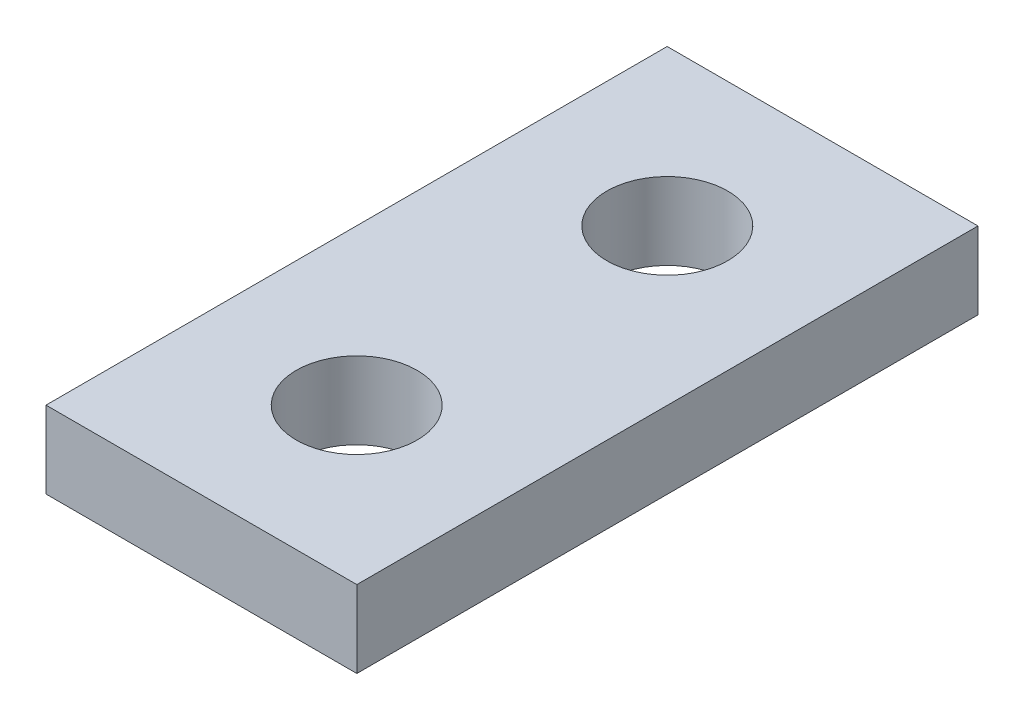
from build123d import *

# Parameters (mm, degrees)
SKETCH1_W           = 9.53262
SKETCH1_H           = 19.05
BOSS_EXTRUDE1_DEPTH = 2.3622
SKETCH2_R           = 1.8542
CUT_EXTRUDE1_DEPTH  = 11.909781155


with BuildPart() as part:
    # Sketch1 → Boss-Extrude1 (new body)
    with BuildSketch(Plane(origin=(0, 0, 0), x_dir=(1, 0, 0), z_dir=(0, 1, 0))):
        Rectangle(SKETCH1_W, SKETCH1_H)
    extrude(amount=BOSS_EXTRUDE1_DEPTH)

    # Sketch2 → Cut-Extrude1 (cut, through all)
    with BuildSketch(Plane(origin=(0, 2.3622, 0), x_dir=(1, 0, 0), z_dir=(0, 1, 0))):
        with Locations(Location((0, 4.7625, 0), (0, 0, 270))):
            Circle(SKETCH2_R)
        with Locations(Location((0, -4.7625, 0), (0, 0, 90))):
            Circle(SKETCH2_R)
    extrude(amount=-CUT_EXTRUDE1_DEPTH, mode=Mode.SUBTRACT)


solid = part.part
